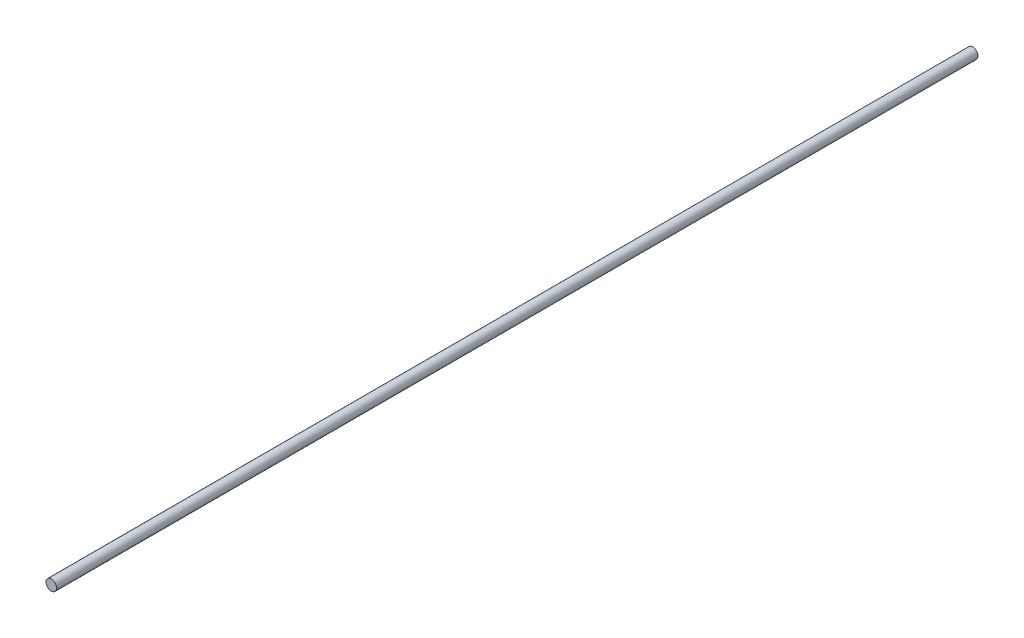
from build123d import *

# Parameters (mm, degrees)
SKETCH1_R           = 30
BOSS_EXTRUDE1_DEPTH = 5250


with BuildPart() as part:
    # Sketch1 → Boss-Extrude1 (new body)
    with BuildSketch(Plane.XY):
        Circle(SKETCH1_R)
    extrude(amount=-BOSS_EXTRUDE1_DEPTH)


solid = part.part
